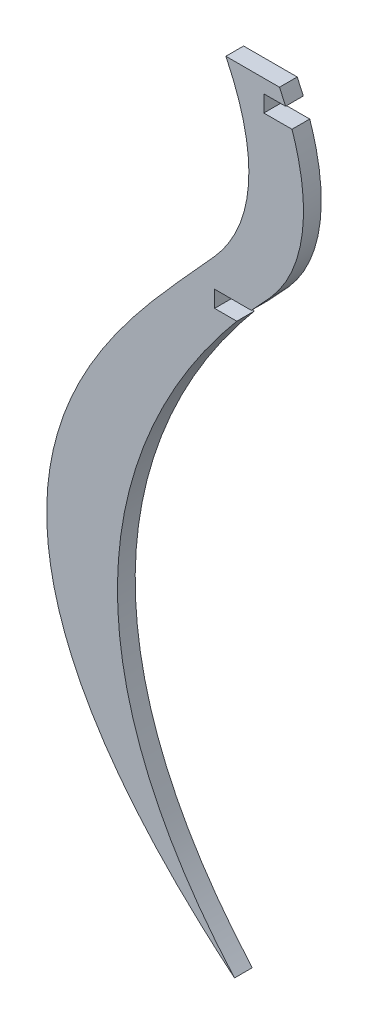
from build123d import *

# Parameters (mm, degrees)
BOSS_EXTRU_1_DEPTH = 5.36


with BuildPart() as part:
    # Esquisse1 → Boss.-Extru.1 (new body)
    with BuildSketch(Plane.XY):
        with BuildLine():
            Line((-239.7917, 144.329), (-223.5846, 144.3294))
            add(Edge.make_bspline(
                [(-223.5846, 144.3294), (-222.9235, 142.9711), (-222.3079, 141.6165), (-221.7374, 140.2667)],
                knots=[0, 0, 0, 0, 1, 1, 1, 1], degree=3))
            Line((-221.7374, 140.2667), (-228.3154, 140.2328))
            Line((-228.3154, 140.2328), (-228.3154, 135.2027))
            Line((-228.3154, 135.2027), (-219.8019, 135.2076))
            add(Edge.make_bspline(
                [(-219.8019, 135.2076), (-213.5219, 116.8631), (-215.766, 99.8215), (-226.2449, 87.996)],
                knots=[0, 0, 0, 0, 0.333333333, 0.333333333, 0.333333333, 0.333333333], degree=3))
            add(Edge.make_bspline(
                [(-226.2449, 87.996), (-227.1269, 87.0011), (-229.2456, 84.8441), (-232.1178, 81.6489)],
                knots=[0.333333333, 0.333333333, 0.333333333, 0.333333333, 1, 1, 1, 1], degree=3))
            Line((-232.1178, 81.6489), (-243.2031, 81.6489))
            Line((-243.2031, 81.6489), (-243.2031, 76.6189))
            Line((-243.2031, 76.6189), (-236.4907, 76.6189))
            add(Edge.make_bspline(
                [(-236.4907, 76.6189), (-259.1311, 49.665), (-304.5292, -19.3041), (-237.1773, -95.6704)],
                knots=[0, 0, 0, 0, 1, 1, 1, 1], degree=3))
            add(Edge.make_bspline(
                [(-237.1773, -95.6704), (-343.5563, -7.3362), (-273.3917, 56.1459), (-243.1945, 90.2231)],
                knots=[0, 0, 0, 0, 0.333333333, 0.333333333, 0.333333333, 0.333333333], degree=3))
            add(Edge.make_bspline(
                [(-243.1945, 90.2231), (-230.9954, 103.9899), (-229.2139, 122.5984), (-239.7917, 144.329)],
                knots=[0.333333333, 0.333333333, 0.333333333, 0.333333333, 1, 1, 1, 1], degree=3))
        make_face()
    extrude(amount=BOSS_EXTRU_1_DEPTH)


solid = part.part
